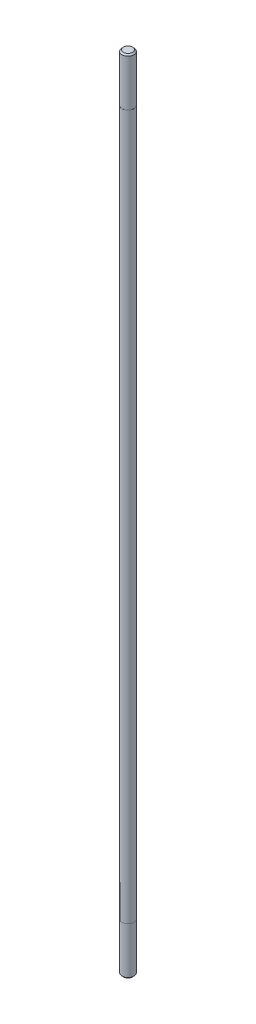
from build123d import *

# Parameters (mm, degrees)
SKETCH1_R      = 1.5
EXTRUDE1_DEPTH = 176
SKETCH2_R      = 1.49
EXTRUDE2_DEPTH = 12
EXTRUDE3_START = 12
SKETCH3_R      = 1.49
EXTRUDE3_DEPTH = 12
CHAMFER1_SIZE  = 0.35
CHAMFER2_SIZE  = 0.35


with BuildPart() as part:
    # Sketch1 → Extrude1 (new body)
    with BuildSketch(Plane(origin=(0, 0, 0), x_dir=(1, 0, 0), z_dir=(0, 1, 0))):
        with Locations(Location((0, 0, 0), (0, 0, 270))):
            Circle(SKETCH1_R)
    extrude(amount=EXTRUDE1_DEPTH)

    # Sketch2 → Extrude2 (add)
    with BuildSketch(Plane(origin=(0, 176, 0), x_dir=(-1, 0, 0), z_dir=(0, 1, 0))):
        with Locations(Location((0, 0, 0), (0, 0, 90))):
            Circle(SKETCH2_R)
    extrude(amount=EXTRUDE2_DEPTH)

    # Sketch3 → Extrude3 (add)
    with BuildSketch(Plane.XZ.offset(EXTRUDE3_START)):
        with Locations(Location((0, 0, 0), (0, 0, 90))):
            Circle(SKETCH3_R)
    extrude(amount=-EXTRUDE3_DEPTH)

    # Chamfer1
    chamfer1_edges = [part.edges().sort_by_distance(p)[0] for p in [
        (0, 188, -1.49),
    ]]
    chamfer(chamfer1_edges, length=CHAMFER1_SIZE)

    # Chamfer2
    chamfer2_edges = [part.edges().sort_by_distance(p)[0] for p in [
        (0, -12, -1.49),
    ]]
    chamfer(chamfer2_edges, length=CHAMFER2_SIZE)


solid = part.part
